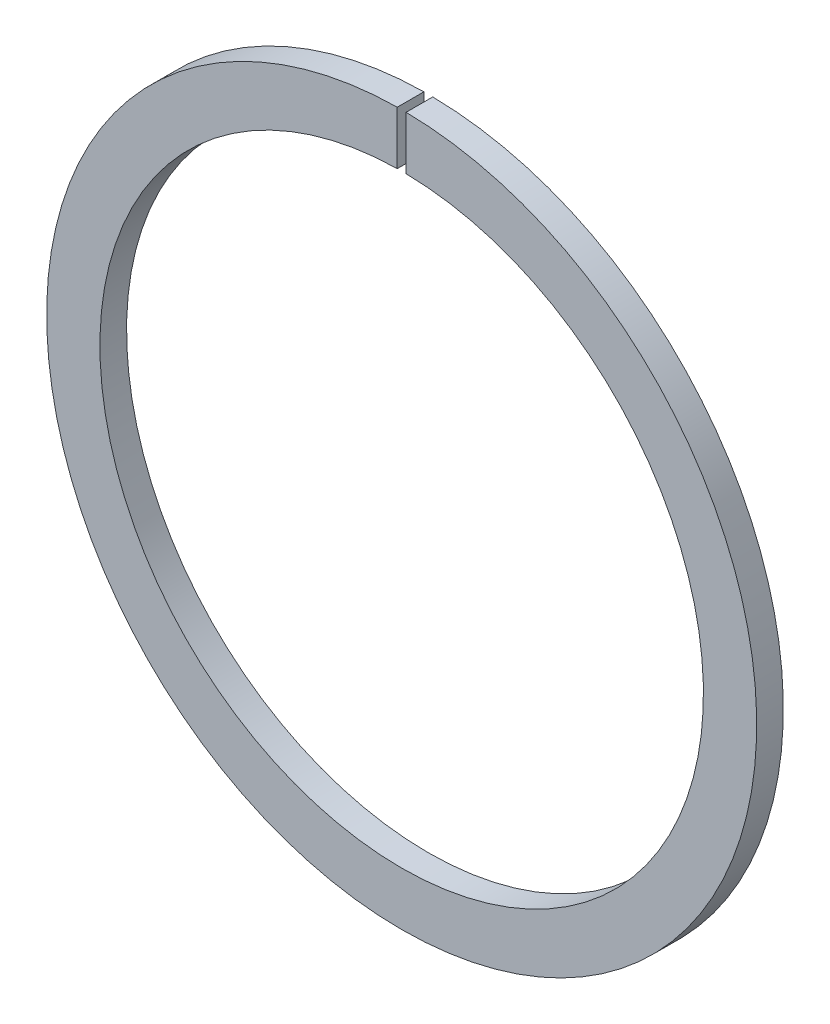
from build123d import *

# Parameters (mm, degrees)
EXTRUSION1_DEPTH = 1.5


with BuildPart() as part:
    # Esquisse1 → Extrusion1 (new body)
    with BuildSketch(Plane.XY):
        with BuildLine():
            Line((-0.25, 16.998161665), (-0.25, 19.998437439))
            ThreePointArc((-0.25, 19.998437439), (0, -20), (0.25, 19.998437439))
            Line((0.25, 19.998437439), (0.25, 16.998161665))
            ThreePointArc((0.25, 16.998161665), (0, -17), (-0.25, 16.998161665))
        make_face()
    extrude(amount=EXTRUSION1_DEPTH)


solid = part.part
